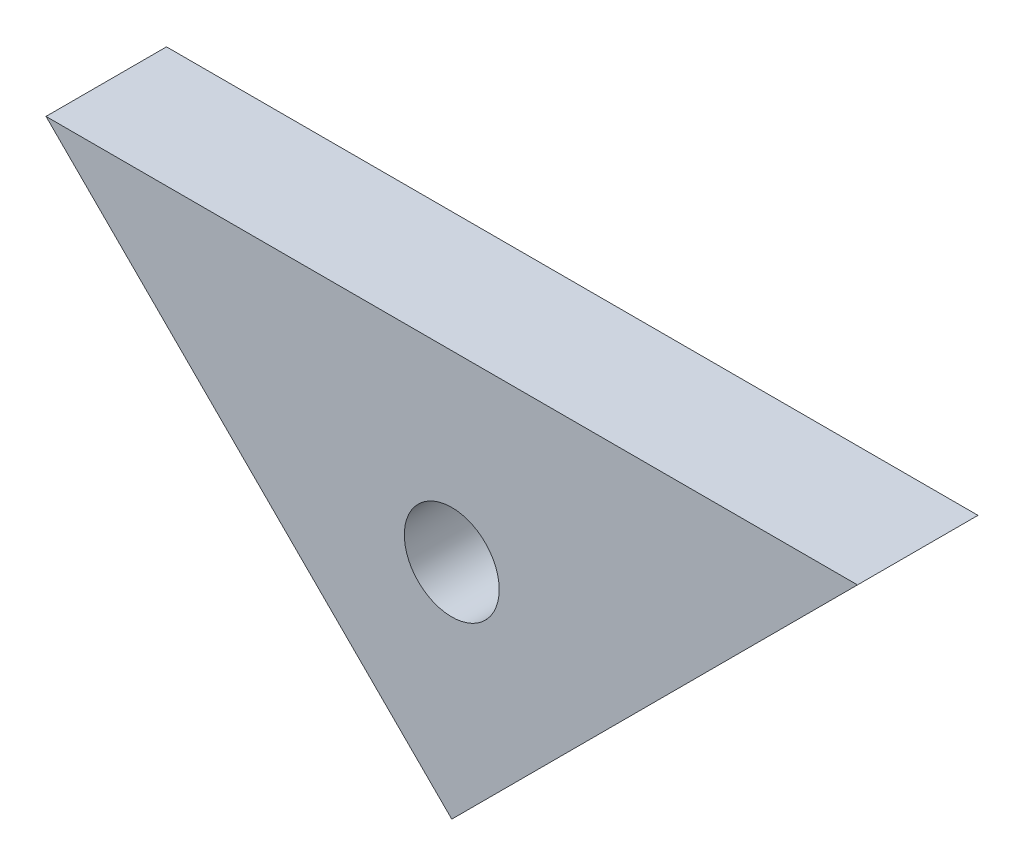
from build123d import *

# Parameters (mm, degrees)
BOSS_EXTRUDE1_DEPTH = 4
SKETCH4_R           = 1.575
CUT_EXTRUDE2_DEPTH  = 5


with BuildPart() as part:
    # Sketch2 → Boss-Extrude1 (new body)
    with BuildSketch(Plane.XY):
        Polygon((0, 0), (13.470384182, 13.470384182), (-13.470384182, 13.470384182), align=None)
    extrude(amount=BOSS_EXTRUDE1_DEPTH)

    # Sketch4 → Cut-Extrude2 (cut)
    with BuildSketch(Plane.XY.offset(4)):
        with Locations((0, 7.38927594)):
            Circle(SKETCH4_R)
    extrude(amount=-CUT_EXTRUDE2_DEPTH, mode=Mode.SUBTRACT)


solid = part.part
